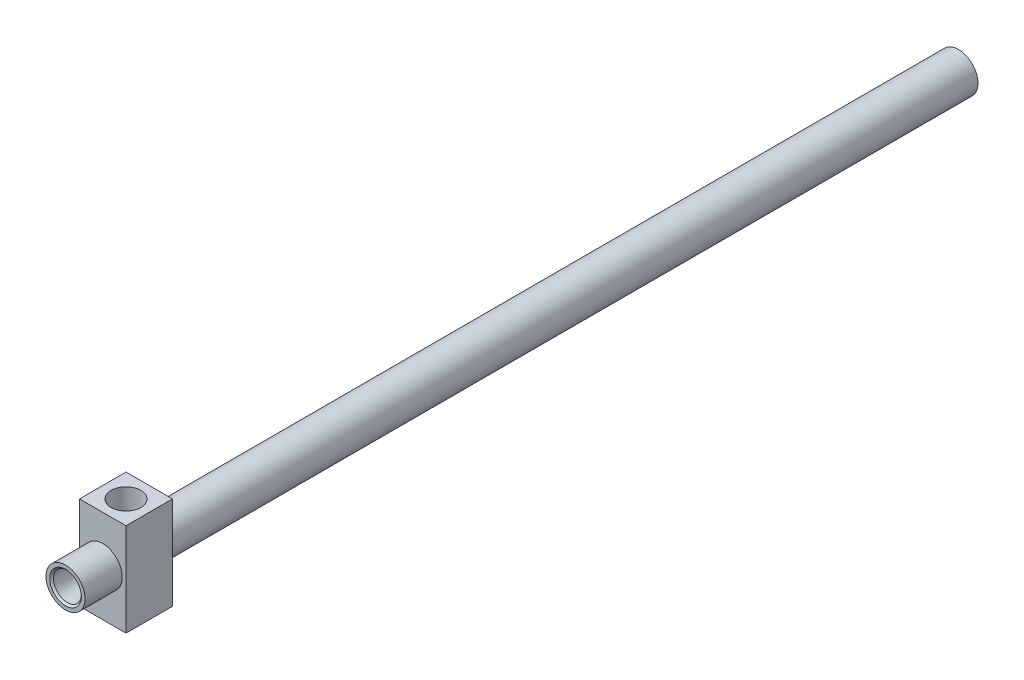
ISO-10303-21;
HEADER;
FILE_DESCRIPTION(('STEP AP214'),'2;1');
FILE_NAME('part.step','',(''),(''),'','','');
FILE_SCHEMA(('AUTOMOTIVE_DESIGN { 1 0 10303 214 1 1 1 1 }'));
ENDSEC;
DATA;
#1=APPLICATION_CONTEXT('core data for automotive mechanical design processes');
#2=APPLICATION_PROTOCOL_DEFINITION('international standard','automotive_design',2000,#1);
#3=PRODUCT_CONTEXT('',#1,'mechanical');
#4=PRODUCT('Part','Part','',(#3));
#5=PRODUCT_RELATED_PRODUCT_CATEGORY('part','',(#4));
#6=PRODUCT_DEFINITION_FORMATION('','',#4);
#7=PRODUCT_DEFINITION_CONTEXT('part definition',#1,'design');
#8=PRODUCT_DEFINITION('design','',#6,#7);
#9=PRODUCT_DEFINITION_SHAPE('','',#8);
#10=(LENGTH_UNIT() NAMED_UNIT(*) SI_UNIT(.MILLI.,.METRE.));
#11=(NAMED_UNIT(*) PLANE_ANGLE_UNIT() SI_UNIT($,.RADIAN.));
#12=(NAMED_UNIT(*) SI_UNIT($,.STERADIAN.) SOLID_ANGLE_UNIT());
#13=UNCERTAINTY_MEASURE_WITH_UNIT(LENGTH_MEASURE(1.E-05),#10,'distance_accuracy_value','');
#14=(GEOMETRIC_REPRESENTATION_CONTEXT(3) GLOBAL_UNCERTAINTY_ASSIGNED_CONTEXT((#13)) GLOBAL_UNIT_ASSIGNED_CONTEXT((#10,
#11,#12)) REPRESENTATION_CONTEXT('',''));
#15=CARTESIAN_POINT('',(0.,0.,0.));
#16=DIRECTION('',(0.,0.,1.));
#17=DIRECTION('',(1.,0.,0.));
#18=AXIS2_PLACEMENT_3D('',#15,#16,#17);
#19=CARTESIAN_POINT('',(0.,25.,12.5));
#20=DIRECTION('',(0.,-1.,0.));
#21=DIRECTION('',(0.,0.,-1.));
#22=AXIS2_PLACEMENT_3D('',#19,#20,#21);
#23=CYLINDRICAL_SURFACE('',#22,5.);
#24=CARTESIAN_POINT('',(0.,7.5,7.5));
#25=CARTESIAN_POINT('',(0.125608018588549,7.49999996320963,7.50000003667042));
#26=CARTESIAN_POINT('',(0.251216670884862,7.49683780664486,7.50473954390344));
#27=CARTESIAN_POINT('',(0.501407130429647,7.48426887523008,7.52362280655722));
#28=CARTESIAN_POINT('',(0.62598893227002,7.47486206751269,7.53776661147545));
#29=CARTESIAN_POINT('',(0.873171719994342,7.45003382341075,7.57524611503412));
#30=CARTESIAN_POINT('',(0.995772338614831,7.43461128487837,7.59858349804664));
#31=CARTESIAN_POINT('',(1.23813427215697,7.39811136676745,7.65412655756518));
#32=CARTESIAN_POINT('',(1.35789435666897,7.37703158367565,7.6863360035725));
#33=CARTESIAN_POINT('',(1.59314893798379,7.32981525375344,7.75901361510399));
#34=CARTESIAN_POINT('',(1.70866231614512,7.30370546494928,7.79943813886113));
#35=CARTESIAN_POINT('',(1.93546860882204,7.24690654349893,7.88818784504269));
#36=CARTESIAN_POINT('',(2.04675985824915,7.21621562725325,7.93651610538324));
#37=CARTESIAN_POINT('',(2.37341381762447,7.1181782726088,8.09261258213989));
#38=CARTESIAN_POINT('',(2.58175996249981,7.04482484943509,8.21155627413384));
#39=CARTESIAN_POINT('',(2.99324442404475,6.88067945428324,8.48665150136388));
#40=CARTESIAN_POINT('',(3.19444057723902,6.78893589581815,8.64510390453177));
#41=CARTESIAN_POINT('',(3.56933031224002,6.5995443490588,8.98934089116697));
#42=CARTESIAN_POINT('',(3.74298373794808,6.50188802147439,9.17516463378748));
#43=CARTESIAN_POINT('',(3.99366214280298,6.34919628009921,9.48797975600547));
#44=CARTESIAN_POINT('',(4.08060552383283,6.29351311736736,9.60683614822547));
#45=CARTESIAN_POINT('',(4.24410607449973,6.18443450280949,9.8524800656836));
#46=CARTESIAN_POINT('',(4.32066088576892,6.13103957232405,9.97926938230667));
#47=CARTESIAN_POINT('',(4.53366662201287,5.97715554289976,10.3707093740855));
#48=CARTESIAN_POINT('',(4.65396866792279,5.88264084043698,10.6470640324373));
#49=CARTESIAN_POINT('',(4.81686735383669,5.74940066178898,11.1418507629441));
#50=CARTESIAN_POINT('',(4.87187088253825,5.70244638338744,11.3539686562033));
#51=CARTESIAN_POINT('',(4.93332515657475,5.64915905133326,11.6787423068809));
#52=CARTESIAN_POINT('',(4.95029943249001,5.63425589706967,11.7880651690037));
#53=CARTESIAN_POINT('',(4.97699249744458,5.61069296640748,12.0082426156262));
#54=CARTESIAN_POINT('',(4.98671389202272,5.6020309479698,12.1190966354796));
#55=CARTESIAN_POINT('',(4.9987551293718,5.59128886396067,12.3420075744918));
#56=CARTESIAN_POINT('',(5.00104278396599,5.58923742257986,12.4540676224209));
#57=CARTESIAN_POINT('',(4.9980849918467,5.5918825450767,12.6780070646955));
#58=CARTESIAN_POINT('',(4.99283951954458,5.59657913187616,12.789886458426));
#59=CARTESIAN_POINT('',(4.97490634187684,5.61252620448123,13.0126360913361));
#60=CARTESIAN_POINT('',(4.96221454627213,5.62378029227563,13.1235057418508));
#61=CARTESIAN_POINT('',(4.92961024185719,5.65238050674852,13.3433965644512));
#62=CARTESIAN_POINT('',(4.90969480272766,5.66972910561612,13.4524169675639));
#63=CARTESIAN_POINT('',(4.84163703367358,5.72818076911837,13.7660345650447));
#64=CARTESIAN_POINT('',(4.78429713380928,5.77653702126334,13.9673662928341));
#65=CARTESIAN_POINT('',(4.64674861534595,5.88774075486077,14.3575962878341));
#66=CARTESIAN_POINT('',(4.56653247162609,5.95059300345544,14.5464904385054));
#67=CARTESIAN_POINT('',(4.36685173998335,6.09910267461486,14.9475453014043));
#68=CARTESIAN_POINT('',(4.24272264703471,6.18679835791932,15.156623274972));
#69=CARTESIAN_POINT('',(3.96670264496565,6.36729804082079,15.5534849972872));
#70=CARTESIAN_POINT('',(3.81477749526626,6.46010824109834,15.7412420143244));
#71=CARTESIAN_POINT('',(3.54969108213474,6.60779163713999,16.024372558));
#72=CARTESIAN_POINT('',(3.44464766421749,6.66328847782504,16.1271308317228));
#73=CARTESIAN_POINT('',(3.22531791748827,6.77217054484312,16.3234771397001));
#74=CARTESIAN_POINT('',(3.11103433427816,6.82555639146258,16.4170678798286));
#75=CARTESIAN_POINT('',(2.87366828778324,6.92883688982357,16.5943823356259));
#76=CARTESIAN_POINT('',(2.75059010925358,6.97873321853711,16.6781108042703));
#77=CARTESIAN_POINT('',(2.49611507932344,7.07374288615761,16.834942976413));
#78=CARTESIAN_POINT('',(2.36472076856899,7.11885767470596,16.9080499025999));
#79=CARTESIAN_POINT('',(2.12083178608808,7.1947926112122,17.029550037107));
#80=CARTESIAN_POINT('',(2.00967972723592,7.22668145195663,17.0799787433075));
#81=CARTESIAN_POINT('',(1.78295269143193,7.2859316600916,17.1729094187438));
#82=CARTESIAN_POINT('',(1.66737861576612,7.31329394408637,17.2154129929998));
#83=CARTESIAN_POINT('',(1.43245611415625,7.36291212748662,17.2920064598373));
#84=CARTESIAN_POINT('',(1.31310930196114,7.38517017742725,17.3260998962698));
#85=CARTESIAN_POINT('',(1.07138735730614,7.42408961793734,17.3854486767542));
#86=CARTESIAN_POINT('',(0.949013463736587,7.44075325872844,17.4107075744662));
#87=CARTESIAN_POINT('',(0.701493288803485,7.4681644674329,17.4521433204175));
#88=CARTESIAN_POINT('',(0.576336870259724,7.4788845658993,17.4682780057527));
#89=CARTESIAN_POINT('',(0.324780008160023,7.4940239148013,17.4910386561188));
#90=CARTESIAN_POINT('',(0.198379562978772,7.49844315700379,17.4976646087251));
#91=CARTESIAN_POINT('',(-0.0546163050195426,7.50086789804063,17.5013019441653));
#92=CARTESIAN_POINT('',(-0.181211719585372,7.49887366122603,17.4983137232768));
#93=CARTESIAN_POINT('',(-0.433544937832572,7.48852351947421,17.4827721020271));
#94=CARTESIAN_POINT('',(-0.559282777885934,7.48016788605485,17.4702191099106));
#95=CARTESIAN_POINT('',(-0.800084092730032,7.45811180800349,17.4369601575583));
#96=CARTESIAN_POINT('',(-0.915274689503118,7.44483013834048,17.4168920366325));
#97=CARTESIAN_POINT('',(-1.14332502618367,7.41323727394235,17.3689225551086));
#98=CARTESIAN_POINT('',(-1.25618396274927,7.39492437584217,17.3410185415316));
#99=CARTESIAN_POINT('',(-1.59016819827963,7.33297199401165,17.24603269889));
#100=CARTESIAN_POINT('',(-1.80689828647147,7.28229985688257,17.1676491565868));
#101=CARTESIAN_POINT('',(-2.2366977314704,7.16240567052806,16.9783628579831));
#102=CARTESIAN_POINT('',(-2.44875011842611,7.09224590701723,16.865777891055));
#103=CARTESIAN_POINT('',(-2.85169789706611,6.94004723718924,16.6139184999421));
#104=CARTESIAN_POINT('',(-3.04258010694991,6.85800100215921,16.4746275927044));
#105=CARTESIAN_POINT('',(-3.42963933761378,6.67386338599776,16.1484797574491));
#106=CARTESIAN_POINT('',(-3.62188054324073,6.57065384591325,15.9575841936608));
#107=CARTESIAN_POINT('',(-3.97334834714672,6.36427940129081,15.5472215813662));
#108=CARTESIAN_POINT('',(-4.13255212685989,6.26111457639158,15.3277349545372));
#109=CARTESIAN_POINT('',(-4.40311961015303,6.07349195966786,14.8821439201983));
#110=CARTESIAN_POINT('',(-4.51739093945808,5.98818993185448,14.6581698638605));
#111=CARTESIAN_POINT('',(-4.71240530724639,5.83597435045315,14.1903184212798));
#112=CARTESIAN_POINT('',(-4.79320869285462,5.76902777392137,13.9464778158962));
#113=CARTESIAN_POINT('',(-4.90589604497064,5.67333023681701,13.48858864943));
#114=CARTESIAN_POINT('',(-4.94396476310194,5.63987506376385,13.2770700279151));
#115=CARTESIAN_POINT('',(-4.99248032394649,5.59698654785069,12.8485672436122));
#116=CARTESIAN_POINT('',(-5.00295716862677,5.58752711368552,12.6315892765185));
#117=CARTESIAN_POINT('',(-4.99559738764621,5.59410544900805,12.1983907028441));
#118=CARTESIAN_POINT('',(-4.97774399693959,5.61015831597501,11.9821706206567));
#119=CARTESIAN_POINT('',(-4.91492740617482,5.66525973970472,11.5566473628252));
#120=CARTESIAN_POINT('',(-4.8699280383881,5.7043389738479,11.3473538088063));
#121=CARTESIAN_POINT('',(-4.73981418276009,5.81317852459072,10.88569278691));
#122=CARTESIAN_POINT('',(-4.64720557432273,5.88833948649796,10.6367080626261));
#123=CARTESIAN_POINT('',(-4.48217153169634,6.0137282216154,10.2802278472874));
#124=CARTESIAN_POINT('',(-4.4227291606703,6.05768608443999,10.164119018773));
#125=CARTESIAN_POINT('',(-4.29553797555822,6.14853438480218,9.93773662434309));
#126=CARTESIAN_POINT('',(-4.22778900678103,6.19542487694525,9.82746316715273));
#127=CARTESIAN_POINT('',(-4.0100125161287,6.34038233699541,9.50186842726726));
#128=CARTESIAN_POINT('',(-3.84739387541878,6.44119239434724,9.29593501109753));
#129=CARTESIAN_POINT('',(-3.58070368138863,6.5908294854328,9.00776376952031));
#130=CARTESIAN_POINT('',(-3.48796686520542,6.64046727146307,8.91512486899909));
#131=CARTESIAN_POINT('',(-3.29502624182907,6.73828470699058,8.73701799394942));
#132=CARTESIAN_POINT('',(-3.19482074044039,6.78646402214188,8.6515516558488));
#133=CARTESIAN_POINT('',(-2.9722858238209,6.88712610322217,8.47652614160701));
#134=CARTESIAN_POINT('',(-2.84884898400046,6.93922872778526,8.38815152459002));
#135=CARTESIAN_POINT('',(-2.59315796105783,7.03877400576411,8.22229780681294));
#136=CARTESIAN_POINT('',(-2.46090780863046,7.08621876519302,8.14481377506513));
#137=CARTESIAN_POINT('',(-2.18836443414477,7.17506685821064,8.00169721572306));
#138=CARTESIAN_POINT('',(-2.04807886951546,7.21647581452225,7.93605364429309));
#139=CARTESIAN_POINT('',(-1.76034275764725,7.29200187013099,7.81754571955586));
#140=CARTESIAN_POINT('',(-1.61289474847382,7.32612152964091,7.76467687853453));
#141=CARTESIAN_POINT('',(-1.3455542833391,7.37927647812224,7.68289967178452));
#142=CARTESIAN_POINT('',(-1.22681585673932,7.39997893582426,7.65127761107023));
#143=CARTESIAN_POINT('',(-0.986541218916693,7.43582405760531,7.59674564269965));
#144=CARTESIAN_POINT('',(-0.865005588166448,7.45096786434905,7.5738339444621));
#145=CARTESIAN_POINT('',(-0.620058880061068,7.47533722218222,7.53705165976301));
#146=CARTESIAN_POINT('',(-0.496648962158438,7.48456629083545,7.52317569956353));
#147=CARTESIAN_POINT('',(-0.24882626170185,7.49689781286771,7.50464967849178));
#148=CARTESIAN_POINT('',(-0.124413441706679,7.50000003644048,7.49999996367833));
#149=CARTESIAN_POINT('',(0.,7.5,7.5));
#150=B_SPLINE_CURVE_WITH_KNOTS('',3,(#24,#25,#26,#27,#28,#29,#30,#31,#32,#33,#34,#35,#36,#37,
#38,#39,#40,#41,#42,#43,#44,#45,#46,#47,#48,#49,#50,#51,#52,#53,#54,#55,#56,#57,#58,#59,#60,#61,
#62,#63,#64,#65,#66,#67,#68,#69,#70,#71,#72,#73,#74,#75,#76,#77,#78,#79,#80,#81,#82,#83,#84,#85,
#86,#87,#88,#89,#90,#91,#92,#93,#94,#95,#96,#97,#98,#99,#100,#101,#102,#103,#104,#105,#106,#107,
#108,#109,#110,#111,#112,#113,#114,#115,#116,#117,#118,#119,#120,#121,#122,#123,#124,#125,#126,
#127,#128,#129,#130,#131,#132,#133,#134,#135,#136,#137,#138,#139,#140,#141,#142,#143,#144,#145,
#146,#147,#148,#149),.UNSPECIFIED.,.T.,.F.,(4,2,2,2,2,2,2,2,2,2,2,2,2,2,2,2,2,2,2,2,2,2,2,2,2,2,
2,2,2,2,2,2,2,2,2,2,2,2,2,2,2,2,2,2,2,2,2,2,2,2,2,2,2,2,2,2,2,2,2,2,2,2,4),(0.,
0.376697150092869,0.7533962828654,1.13016446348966,1.5070929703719,1.88206910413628,
2.2571916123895,3.00679232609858,3.82000195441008,4.63438651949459,5.10618372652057,
5.57808786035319,6.5193034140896,7.18876311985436,7.52328813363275,7.85769291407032,
8.19354375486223,8.52939573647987,8.86543237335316,9.20160547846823,9.84356710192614,
10.4857401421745,11.2585349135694,12.032288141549,12.5030398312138,12.9736521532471,
13.44403673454,13.9142782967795,14.2923626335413,14.6703703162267,15.0482184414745,
15.4259144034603,15.8053417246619,16.184769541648,16.5641817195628,16.9435777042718,
17.2962009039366,17.6489436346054,18.3538353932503,19.1014251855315,19.8494778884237,
20.7158209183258,21.5827603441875,22.3763648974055,23.1685321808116,23.8182177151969,
24.4671965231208,25.1165595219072,25.7667896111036,26.5902817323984,27.0029102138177,
27.4155463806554,28.2552096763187,28.6754157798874,29.0957174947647,29.5765774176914,
30.0572189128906,30.5374097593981,31.0174316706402,31.3908313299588,31.7641541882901,
32.1372548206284,32.5103694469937),.UNSPECIFIED.);
#151=CARTESIAN_POINT('',(0.,7.5,7.5));
#152=VERTEX_POINT('',#151);
#153=EDGE_CURVE('E209',#152,#152,#150,.T.);
#154=ORIENTED_EDGE('',*,*,#153,.T.);
#155=EDGE_LOOP('',(#154));
#156=FACE_BOUND('',#155,.T.);
#157=CARTESIAN_POINT('',(0.,10.5,12.5));
#158=DIRECTION('',(0.,1.,0.));
#159=DIRECTION('',(0.,0.,1.));
#160=AXIS2_PLACEMENT_3D('',#157,#158,#159);
#161=CIRCLE('',#160,5.);
#162=CARTESIAN_POINT('',(0.,10.5,17.5));
#163=VERTEX_POINT('',#162);
#164=EDGE_CURVE('E120',#163,#163,#161,.T.);
#165=ORIENTED_EDGE('',*,*,#164,.T.);
#166=EDGE_LOOP('',(#165));
#167=FACE_BOUND('',#166,.T.);
#168=ADVANCED_FACE('F26',(#156,#167),#23,.F.);
#169=CARTESIAN_POINT('',(-12.5,25.,25.));
#170=DIRECTION('',(0.,0.,-1.));
#171=DIRECTION('',(-1.,0.,0.));
#172=AXIS2_PLACEMENT_3D('',#169,#170,#171);
#173=PLANE('',#172);
#174=DIRECTION('',(1.,0.,0.));
#175=VECTOR('',#174,1.);
#176=CARTESIAN_POINT('',(-12.5,-25.,25.));
#177=LINE('',#176,#175);
#178=CARTESIAN_POINT('',(-12.5,-25.,25.));
#179=VERTEX_POINT('',#178);
#180=CARTESIAN_POINT('',(12.5,-25.,25.));
#181=VERTEX_POINT('',#180);
#182=EDGE_CURVE('E67',#179,#181,#177,.T.);
#183=ORIENTED_EDGE('',*,*,#182,.T.);
#184=DIRECTION('',(0.,-1.,0.));
#185=VECTOR('',#184,1.);
#186=CARTESIAN_POINT('',(12.5,25.,25.));
#187=LINE('',#186,#185);
#188=CARTESIAN_POINT('',(12.5,25.,25.));
#189=VERTEX_POINT('',#188);
#190=EDGE_CURVE('E86',#189,#181,#187,.T.);
#191=ORIENTED_EDGE('',*,*,#190,.F.);
#192=DIRECTION('',(1.,0.,0.));
#193=VECTOR('',#192,1.);
#194=CARTESIAN_POINT('',(-12.5,25.,25.));
#195=LINE('',#194,#193);
#196=CARTESIAN_POINT('',(-12.5,25.,25.));
#197=VERTEX_POINT('',#196);
#198=EDGE_CURVE('E82',#197,#189,#195,.T.);
#199=ORIENTED_EDGE('',*,*,#198,.F.);
#200=DIRECTION('',(0.,-1.,0.));
#201=VECTOR('',#200,1.);
#202=CARTESIAN_POINT('',(-12.5,25.,25.));
#203=LINE('',#202,#201);
#204=EDGE_CURVE('E79',#197,#179,#203,.T.);
#205=ORIENTED_EDGE('',*,*,#204,.T.);
#206=EDGE_LOOP('',(#183,#191,#199,#205));
#207=FACE_BOUND('',#206,.T.);
#208=CARTESIAN_POINT('',(0.,0.,25.));
#209=DIRECTION('',(0.,0.,-1.));
#210=DIRECTION('',(-1.,0.,0.));
#211=AXIS2_PLACEMENT_3D('',#208,#209,#210);
#212=CIRCLE('',#211,10.5);
#213=CARTESIAN_POINT('',(-10.5,0.,25.));
#214=VERTEX_POINT('',#213);
#215=EDGE_CURVE('E116',#214,#214,#212,.F.);
#216=ORIENTED_EDGE('',*,*,#215,.F.);
#217=EDGE_LOOP('',(#216));
#218=FACE_BOUND('',#217,.T.);
#219=ADVANCED_FACE('F80',(#207,#218),#173,.F.);
#220=CARTESIAN_POINT('',(0.,0.,-435.));
#221=DIRECTION('',(0.,0.,1.));
#222=DIRECTION('',(1.,0.,0.));
#223=AXIS2_PLACEMENT_3D('',#220,#221,#222);
#224=CYLINDRICAL_SURFACE('',#223,10.5);
#225=CARTESIAN_POINT('',(0.,0.,-435.));
#226=DIRECTION('',(0.,0.,1.));
#227=DIRECTION('',(1.,0.,0.));
#228=AXIS2_PLACEMENT_3D('',#225,#226,#227);
#229=CIRCLE('',#228,10.5);
#230=CARTESIAN_POINT('',(10.5,0.,-435.));
#231=VERTEX_POINT('',#230);
#232=EDGE_CURVE('E113',#231,#231,#229,.T.);
#233=CARTESIAN_POINT('',(0.,0.,0.));
#234=DIRECTION('',(0.,0.,1.));
#235=DIRECTION('',(1.,0.,0.));
#236=AXIS2_PLACEMENT_3D('',#233,#234,#235);
#237=CIRCLE('',#236,10.5);
#238=CARTESIAN_POINT('',(10.5,0.,0.));
#239=VERTEX_POINT('',#238);
#240=EDGE_CURVE('E85',#239,#239,#237,.T.);
#241=CARTESIAN_POINT('',(10.5,0.,-435.));
#242=CARTESIAN_POINT('',(10.5,0.,-430.46875));
#243=CARTESIAN_POINT('',(10.5,0.,-425.9375));
#244=CARTESIAN_POINT('',(10.5,0.,-416.875));
#245=CARTESIAN_POINT('',(10.5,0.,-412.34375));
#246=CARTESIAN_POINT('',(10.5,0.,-403.28125));
#247=CARTESIAN_POINT('',(10.5,0.,-398.75));
#248=CARTESIAN_POINT('',(10.5,0.,-389.6875));
#249=CARTESIAN_POINT('',(10.5,0.,-385.15625));
#250=CARTESIAN_POINT('',(10.5,0.,-376.09375));
#251=CARTESIAN_POINT('',(10.5,0.,-371.5625));
#252=CARTESIAN_POINT('',(10.5,0.,-362.5));
#253=CARTESIAN_POINT('',(10.5,0.,-357.96875));
#254=CARTESIAN_POINT('',(10.5,0.,-348.90625));
#255=CARTESIAN_POINT('',(10.5,0.,-344.375));
#256=CARTESIAN_POINT('',(10.5,0.,-335.3125));
#257=CARTESIAN_POINT('',(10.5,0.,-330.78125));
#258=CARTESIAN_POINT('',(10.5,0.,-321.71875));
#259=CARTESIAN_POINT('',(10.5,0.,-317.1875));
#260=CARTESIAN_POINT('',(10.5,0.,-308.125));
#261=CARTESIAN_POINT('',(10.5,0.,-303.59375));
#262=CARTESIAN_POINT('',(10.5,0.,-294.53125));
#263=CARTESIAN_POINT('',(10.5,0.,-290.));
#264=CARTESIAN_POINT('',(10.5,0.,-280.9375));
#265=CARTESIAN_POINT('',(10.5,0.,-276.40625));
#266=CARTESIAN_POINT('',(10.5,0.,-267.34375));
#267=CARTESIAN_POINT('',(10.5,0.,-262.8125));
#268=CARTESIAN_POINT('',(10.5,0.,-253.75));
#269=CARTESIAN_POINT('',(10.5,0.,-249.21875));
#270=CARTESIAN_POINT('',(10.5,0.,-240.15625));
#271=CARTESIAN_POINT('',(10.5,0.,-235.625));
#272=CARTESIAN_POINT('',(10.5,0.,-226.5625));
#273=CARTESIAN_POINT('',(10.5,0.,-222.03125));
#274=CARTESIAN_POINT('',(10.5,0.,-212.96875));
#275=CARTESIAN_POINT('',(10.5,0.,-208.4375));
#276=CARTESIAN_POINT('',(10.5,0.,-199.375));
#277=CARTESIAN_POINT('',(10.5,0.,-194.84375));
#278=CARTESIAN_POINT('',(10.5,0.,-185.78125));
#279=CARTESIAN_POINT('',(10.5,0.,-181.25));
#280=CARTESIAN_POINT('',(10.5,0.,-172.1875));
#281=CARTESIAN_POINT('',(10.5,0.,-167.65625));
#282=CARTESIAN_POINT('',(10.5,0.,-158.59375));
#283=CARTESIAN_POINT('',(10.5,0.,-154.0625));
#284=CARTESIAN_POINT('',(10.5,0.,-145.));
#285=CARTESIAN_POINT('',(10.5,0.,-140.46875));
#286=CARTESIAN_POINT('',(10.5,0.,-131.40625));
#287=CARTESIAN_POINT('',(10.5,0.,-126.875));
#288=CARTESIAN_POINT('',(10.5,0.,-117.8125));
#289=CARTESIAN_POINT('',(10.5,0.,-113.28125));
#290=CARTESIAN_POINT('',(10.5,0.,-104.21875));
#291=CARTESIAN_POINT('',(10.5,0.,-99.6875));
#292=CARTESIAN_POINT('',(10.5,0.,-90.625));
#293=CARTESIAN_POINT('',(10.5,0.,-86.09375));
#294=CARTESIAN_POINT('',(10.5,0.,-77.03125));
#295=CARTESIAN_POINT('',(10.5,0.,-72.5));
#296=CARTESIAN_POINT('',(10.5,0.,-63.4375));
#297=CARTESIAN_POINT('',(10.5,0.,-58.90625));
#298=CARTESIAN_POINT('',(10.5,0.,-49.84375));
#299=CARTESIAN_POINT('',(10.5,0.,-45.3125));
#300=CARTESIAN_POINT('',(10.5,0.,-36.25));
#301=CARTESIAN_POINT('',(10.5,0.,-31.71875));
#302=CARTESIAN_POINT('',(10.5,0.,-22.65625));
#303=CARTESIAN_POINT('',(10.5,0.,-18.125));
#304=CARTESIAN_POINT('',(10.5,0.,-9.06250000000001));
#305=CARTESIAN_POINT('',(10.5,0.,-4.53125));
#306=CARTESIAN_POINT('',(10.5,0.,0.));
#307=B_SPLINE_CURVE_WITH_KNOTS('',3,(#241,#242,#243,#244,#245,#246,#247,#248,#249,#250,#251,
#252,#253,#254,#255,#256,#257,#258,#259,#260,#261,#262,#263,#264,#265,#266,#267,#268,#269,#270,
#271,#272,#273,#274,#275,#276,#277,#278,#279,#280,#281,#282,#283,#284,#285,#286,#287,#288,#289,
#290,#291,#292,#293,#294,#295,#296,#297,#298,#299,#300,#301,#302,#303,#304,#305,#306),
.UNSPECIFIED.,.F.,.F.,(4,2,2,2,2,2,2,2,2,2,2,2,2,2,2,2,2,2,2,2,2,2,2,2,2,2,2,2,2,2,2,2,4),(0.,
13.59375,27.1875,40.78125,54.375,67.96875,81.5625,95.15625,108.75,122.34375,135.9375,149.53125,
163.125,176.71875,190.3125,203.90625,217.5,231.09375,244.6875,258.28125,271.875,285.46875,
299.0625,312.65625,326.25,339.84375,353.4375,367.03125,380.625,394.21875,407.8125,421.40625,
435.),.UNSPECIFIED.);
#308=EDGE_CURVE('BSEAM28',#231,#239,#307,.T.);
#309=ORIENTED_EDGE('',*,*,#232,.T.);
#310=ORIENTED_EDGE('',*,*,#240,.F.);
#311=ORIENTED_EDGE('',*,*,#308,.T.);
#312=ORIENTED_EDGE('',*,*,#308,.F.);
#313=EDGE_LOOP('',(#309,#311,#310,#312));
#314=FACE_BOUND('',#313,.T.);
#315=ADVANCED_FACE('F28',(#314),#224,.T.);
#316=CARTESIAN_POINT('',(0.,0.,-435.));
#317=DIRECTION('',(0.,0.,1.));
#318=DIRECTION('',(1.,0.,0.));
#319=AXIS2_PLACEMENT_3D('',#316,#317,#318);
#320=PLANE('',#319);
#321=CARTESIAN_POINT('',(0.,0.,-435.));
#322=DIRECTION('',(0.,0.,1.));
#323=DIRECTION('',(1.,0.,0.));
#324=AXIS2_PLACEMENT_3D('',#321,#322,#323);
#325=CIRCLE('',#324,8.5);
#326=CARTESIAN_POINT('',(8.5,0.,-435.));
#327=VERTEX_POINT('',#326);
#328=EDGE_CURVE('E124',#327,#327,#325,.T.);
#329=ORIENTED_EDGE('',*,*,#328,.T.);
#330=EDGE_LOOP('',(#329));
#331=FACE_BOUND('',#330,.T.);
#332=ORIENTED_EDGE('',*,*,#232,.F.);
#333=EDGE_LOOP('',(#332));
#334=FACE_BOUND('',#333,.T.);
#335=ADVANCED_FACE('F142',(#331,#334),#320,.F.);
#336=CARTESIAN_POINT('',(-12.5,25.,0.));
#337=DIRECTION('',(1.,0.,0.));
#338=DIRECTION('',(0.,0.,-1.));
#339=AXIS2_PLACEMENT_3D('',#336,#337,#338);
#340=PLANE('',#339);
#341=DIRECTION('',(0.,0.,1.));
#342=VECTOR('',#341,1.);
#343=CARTESIAN_POINT('',(-12.5,-25.,0.));
#344=LINE('',#343,#342);
#345=CARTESIAN_POINT('',(-12.5,-25.,0.));
#346=VERTEX_POINT('',#345);
#347=EDGE_CURVE('E72',#346,#179,#344,.T.);
#348=ORIENTED_EDGE('',*,*,#347,.T.);
#349=ORIENTED_EDGE('',*,*,#204,.F.);
#350=DIRECTION('',(0.,0.,1.));
#351=VECTOR('',#350,1.);
#352=CARTESIAN_POINT('',(-12.5,25.,0.));
#353=LINE('',#352,#351);
#354=CARTESIAN_POINT('',(-12.5,25.,0.));
#355=VERTEX_POINT('',#354);
#356=EDGE_CURVE('E101',#355,#197,#353,.T.);
#357=ORIENTED_EDGE('',*,*,#356,.F.);
#358=DIRECTION('',(0.,-1.,0.));
#359=VECTOR('',#358,1.);
#360=CARTESIAN_POINT('',(-12.5,25.,0.));
#361=LINE('',#360,#359);
#362=EDGE_CURVE('E90',#355,#346,#361,.T.);
#363=ORIENTED_EDGE('',*,*,#362,.T.);
#364=EDGE_LOOP('',(#348,#349,#357,#363));
#365=FACE_BOUND('',#364,.T.);
#366=ADVANCED_FACE('F89',(#365),#340,.F.);
#367=CARTESIAN_POINT('',(12.5,25.,0.));
#368=DIRECTION('',(-1.,0.,0.));
#369=DIRECTION('',(0.,0.,1.));
#370=AXIS2_PLACEMENT_3D('',#367,#368,#369);
#371=PLANE('',#370);
#372=DIRECTION('',(0.,0.,-1.));
#373=VECTOR('',#372,1.);
#374=CARTESIAN_POINT('',(12.5,-25.,0.));
#375=LINE('',#374,#373);
#376=CARTESIAN_POINT('',(12.5,-25.,0.));
#377=VERTEX_POINT('',#376);
#378=EDGE_CURVE('E73',#181,#377,#375,.T.);
#379=ORIENTED_EDGE('',*,*,#378,.T.);
#380=DIRECTION('',(0.,-1.,0.));
#381=VECTOR('',#380,1.);
#382=CARTESIAN_POINT('',(12.5,25.,0.));
#383=LINE('',#382,#381);
#384=CARTESIAN_POINT('',(12.5,25.,0.));
#385=VERTEX_POINT('',#384);
#386=EDGE_CURVE('E107',#385,#377,#383,.T.);
#387=ORIENTED_EDGE('',*,*,#386,.F.);
#388=DIRECTION('',(0.,0.,-1.));
#389=VECTOR('',#388,1.);
#390=CARTESIAN_POINT('',(12.5,25.,0.));
#391=LINE('',#390,#389);
#392=EDGE_CURVE('E46',#189,#385,#391,.T.);
#393=ORIENTED_EDGE('',*,*,#392,.F.);
#394=ORIENTED_EDGE('',*,*,#190,.T.);
#395=EDGE_LOOP('',(#379,#387,#393,#394));
#396=FACE_BOUND('',#395,.T.);
#397=ADVANCED_FACE('F155',(#396),#371,.F.);
#398=CARTESIAN_POINT('',(-12.5,25.,0.));
#399=DIRECTION('',(0.,0.,1.));
#400=DIRECTION('',(1.,0.,0.));
#401=AXIS2_PLACEMENT_3D('',#398,#399,#400);
#402=PLANE('',#401);
#403=ORIENTED_EDGE('',*,*,#240,.T.);
#404=EDGE_LOOP('',(#403));
#405=FACE_BOUND('',#404,.T.);
#406=DIRECTION('',(-1.,0.,0.));
#407=VECTOR('',#406,1.);
#408=CARTESIAN_POINT('',(-12.5,-25.,0.));
#409=LINE('',#408,#407);
#410=EDGE_CURVE('E99',#377,#346,#409,.T.);
#411=ORIENTED_EDGE('',*,*,#410,.T.);
#412=ORIENTED_EDGE('',*,*,#362,.F.);
#413=DIRECTION('',(-1.,0.,0.));
#414=VECTOR('',#413,1.);
#415=CARTESIAN_POINT('',(-12.5,25.,0.));
#416=LINE('',#415,#414);
#417=EDGE_CURVE('E41',#385,#355,#416,.T.);
#418=ORIENTED_EDGE('',*,*,#417,.F.);
#419=ORIENTED_EDGE('',*,*,#386,.T.);
#420=EDGE_LOOP('',(#411,#412,#418,#419));
#421=FACE_BOUND('',#420,.T.);
#422=ADVANCED_FACE('F151',(#405,#421),#402,.F.);
#423=CARTESIAN_POINT('',(-12.5,25.,25.));
#424=DIRECTION('',(0.,1.,0.));
#425=DIRECTION('',(0.,0.,1.));
#426=AXIS2_PLACEMENT_3D('',#423,#424,#425);
#427=PLANE('',#426);
#428=CARTESIAN_POINT('',(0.,25.,12.5));
#429=DIRECTION('',(0.,1.,0.));
#430=DIRECTION('',(0.,0.,1.));
#431=AXIS2_PLACEMENT_3D('',#428,#429,#430);
#432=CIRCLE('',#431,8.);
#433=CARTESIAN_POINT('',(0.,25.,20.5));
#434=VERTEX_POINT('',#433);
#435=EDGE_CURVE('E94',#434,#434,#432,.T.);
#436=ORIENTED_EDGE('',*,*,#435,.F.);
#437=EDGE_LOOP('',(#436));
#438=FACE_BOUND('',#437,.T.);
#439=ORIENTED_EDGE('',*,*,#356,.T.);
#440=ORIENTED_EDGE('',*,*,#198,.T.);
#441=ORIENTED_EDGE('',*,*,#392,.T.);
#442=ORIENTED_EDGE('',*,*,#417,.T.);
#443=EDGE_LOOP('',(#439,#440,#441,#442));
#444=FACE_BOUND('',#443,.T.);
#445=ADVANCED_FACE('F154',(#438,#444),#427,.T.);
#446=CARTESIAN_POINT('',(-12.5,-25.,25.));
#447=DIRECTION('',(0.,1.,0.));
#448=DIRECTION('',(0.,0.,1.));
#449=AXIS2_PLACEMENT_3D('',#446,#447,#448);
#450=PLANE('',#449);
#451=CARTESIAN_POINT('',(0.,-25.,12.5));
#452=DIRECTION('',(0.,-1.,0.));
#453=DIRECTION('',(0.,0.,-1.));
#454=AXIS2_PLACEMENT_3D('',#451,#452,#453);
#455=CIRCLE('',#454,8.);
#456=CARTESIAN_POINT('',(0.,-25.,4.5));
#457=VERTEX_POINT('',#456);
#458=EDGE_CURVE('E199',#457,#457,#455,.T.);
#459=ORIENTED_EDGE('',*,*,#458,.F.);
#460=EDGE_LOOP('',(#459));
#461=FACE_BOUND('',#460,.T.);
#462=ORIENTED_EDGE('',*,*,#347,.F.);
#463=ORIENTED_EDGE('',*,*,#410,.F.);
#464=ORIENTED_EDGE('',*,*,#378,.F.);
#465=ORIENTED_EDGE('',*,*,#182,.F.);
#466=EDGE_LOOP('',(#462,#463,#464,#465));
#467=FACE_BOUND('',#466,.T.);
#468=ADVANCED_FACE('F69',(#461,#467),#450,.F.);
#469=CARTESIAN_POINT('',(0.,10.5,12.5));
#470=DIRECTION('',(0.,1.,0.));
#471=DIRECTION('',(0.,0.,1.));
#472=AXIS2_PLACEMENT_3D('',#469,#470,#471);
#473=CYLINDRICAL_SURFACE('',#472,8.);
#474=CARTESIAN_POINT('',(0.,10.5,12.5));
#475=DIRECTION('',(0.,1.,0.));
#476=DIRECTION('',(0.,0.,1.));
#477=AXIS2_PLACEMENT_3D('',#474,#475,#476);
#478=CIRCLE('',#477,8.);
#479=CARTESIAN_POINT('',(0.,10.5,20.5));
#480=VERTEX_POINT('',#479);
#481=EDGE_CURVE('E91',#480,#480,#478,.T.);
#482=CARTESIAN_POINT('',(0.,10.5,20.5));
#483=CARTESIAN_POINT('',(0.,10.6510416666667,20.5));
#484=CARTESIAN_POINT('',(0.,10.8020833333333,20.5));
#485=CARTESIAN_POINT('',(0.,11.1041666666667,20.5));
#486=CARTESIAN_POINT('',(0.,11.2552083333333,20.5));
#487=CARTESIAN_POINT('',(0.,11.5572916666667,20.5));
#488=CARTESIAN_POINT('',(0.,11.7083333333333,20.5));
#489=CARTESIAN_POINT('',(0.,12.0104166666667,20.5));
#490=CARTESIAN_POINT('',(0.,12.1614583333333,20.5));
#491=CARTESIAN_POINT('',(0.,12.4635416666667,20.5));
#492=CARTESIAN_POINT('',(0.,12.6145833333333,20.5));
#493=CARTESIAN_POINT('',(0.,12.9166666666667,20.5));
#494=CARTESIAN_POINT('',(0.,13.0677083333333,20.5));
#495=CARTESIAN_POINT('',(0.,13.3697916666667,20.5));
#496=CARTESIAN_POINT('',(0.,13.5208333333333,20.5));
#497=CARTESIAN_POINT('',(0.,13.8229166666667,20.5));
#498=CARTESIAN_POINT('',(0.,13.9739583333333,20.5));
#499=CARTESIAN_POINT('',(0.,14.2760416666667,20.5));
#500=CARTESIAN_POINT('',(0.,14.4270833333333,20.5));
#501=CARTESIAN_POINT('',(0.,14.7291666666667,20.5));
#502=CARTESIAN_POINT('',(0.,14.8802083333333,20.5));
#503=CARTESIAN_POINT('',(0.,15.1822916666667,20.5));
#504=CARTESIAN_POINT('',(0.,15.3333333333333,20.5));
#505=CARTESIAN_POINT('',(0.,15.6354166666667,20.5));
#506=CARTESIAN_POINT('',(0.,15.7864583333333,20.5));
#507=CARTESIAN_POINT('',(0.,16.0885416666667,20.5));
#508=CARTESIAN_POINT('',(0.,16.2395833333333,20.5));
#509=CARTESIAN_POINT('',(0.,16.5416666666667,20.5));
#510=CARTESIAN_POINT('',(0.,16.6927083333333,20.5));
#511=CARTESIAN_POINT('',(0.,16.9947916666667,20.5));
#512=CARTESIAN_POINT('',(0.,17.1458333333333,20.5));
#513=CARTESIAN_POINT('',(0.,17.4479166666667,20.5));
#514=CARTESIAN_POINT('',(0.,17.5989583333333,20.5));
#515=CARTESIAN_POINT('',(0.,17.9010416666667,20.5));
#516=CARTESIAN_POINT('',(0.,18.0520833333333,20.5));
#517=CARTESIAN_POINT('',(0.,18.3541666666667,20.5));
#518=CARTESIAN_POINT('',(0.,18.5052083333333,20.5));
#519=CARTESIAN_POINT('',(0.,18.8072916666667,20.5));
#520=CARTESIAN_POINT('',(0.,18.9583333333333,20.5));
#521=CARTESIAN_POINT('',(0.,19.2604166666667,20.5));
#522=CARTESIAN_POINT('',(0.,19.4114583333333,20.5));
#523=CARTESIAN_POINT('',(0.,19.7135416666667,20.5));
#524=CARTESIAN_POINT('',(0.,19.8645833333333,20.5));
#525=CARTESIAN_POINT('',(0.,20.1666666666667,20.5));
#526=CARTESIAN_POINT('',(0.,20.3177083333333,20.5));
#527=CARTESIAN_POINT('',(0.,20.6197916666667,20.5));
#528=CARTESIAN_POINT('',(0.,20.7708333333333,20.5));
#529=CARTESIAN_POINT('',(0.,21.0729166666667,20.5));
#530=CARTESIAN_POINT('',(0.,21.2239583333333,20.5));
#531=CARTESIAN_POINT('',(0.,21.5260416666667,20.5));
#532=CARTESIAN_POINT('',(0.,21.6770833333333,20.5));
#533=CARTESIAN_POINT('',(0.,21.9791666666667,20.5));
#534=CARTESIAN_POINT('',(0.,22.1302083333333,20.5));
#535=CARTESIAN_POINT('',(0.,22.4322916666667,20.5));
#536=CARTESIAN_POINT('',(0.,22.5833333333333,20.5));
#537=CARTESIAN_POINT('',(0.,22.8854166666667,20.5));
#538=CARTESIAN_POINT('',(0.,23.0364583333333,20.5));
#539=CARTESIAN_POINT('',(0.,23.3385416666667,20.5));
#540=CARTESIAN_POINT('',(0.,23.4895833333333,20.5));
#541=CARTESIAN_POINT('',(0.,23.7916666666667,20.5));
#542=CARTESIAN_POINT('',(0.,23.9427083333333,20.5));
#543=CARTESIAN_POINT('',(0.,24.2447916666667,20.5));
#544=CARTESIAN_POINT('',(0.,24.3958333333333,20.5));
#545=CARTESIAN_POINT('',(0.,24.6979166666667,20.5));
#546=CARTESIAN_POINT('',(0.,24.8489583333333,20.5));
#547=CARTESIAN_POINT('',(0.,25.,20.5));
#548=B_SPLINE_CURVE_WITH_KNOTS('',3,(#482,#483,#484,#485,#486,#487,#488,#489,#490,#491,#492,
#493,#494,#495,#496,#497,#498,#499,#500,#501,#502,#503,#504,#505,#506,#507,#508,#509,#510,#511,
#512,#513,#514,#515,#516,#517,#518,#519,#520,#521,#522,#523,#524,#525,#526,#527,#528,#529,#530,
#531,#532,#533,#534,#535,#536,#537,#538,#539,#540,#541,#542,#543,#544,#545,#546,#547),
.UNSPECIFIED.,.F.,.F.,(4,2,2,2,2,2,2,2,2,2,2,2,2,2,2,2,2,2,2,2,2,2,2,2,2,2,2,2,2,2,2,2,4),(0.,
0.453124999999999,0.906249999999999,1.359375,1.8125,2.265625,2.71875,3.171875,3.625,4.078125,
4.53125,4.984375,5.4375,5.890625,6.34375,6.796875,7.25,7.703125,8.15625,8.609375,9.0625,
9.515625,9.96875,10.421875,10.875,11.328125,11.78125,12.234375,12.6875,13.140625,13.59375,
14.046875,14.5),.UNSPECIFIED.);
#549=EDGE_CURVE('BSEAM280',#480,#434,#548,.T.);
#550=ORIENTED_EDGE('',*,*,#481,.F.);
#551=ORIENTED_EDGE('',*,*,#435,.T.);
#552=ORIENTED_EDGE('',*,*,#549,.T.);
#553=ORIENTED_EDGE('',*,*,#549,.F.);
#554=EDGE_LOOP('',(#550,#552,#551,#553));
#555=FACE_BOUND('',#554,.T.);
#556=ADVANCED_FACE('F280',(#555),#473,.F.);
#557=CARTESIAN_POINT('',(0.,10.5,12.5));
#558=DIRECTION('',(0.,1.,0.));
#559=DIRECTION('',(0.,0.,1.));
#560=AXIS2_PLACEMENT_3D('',#557,#558,#559);
#561=PLANE('',#560);
#562=ORIENTED_EDGE('',*,*,#164,.F.);
#563=EDGE_LOOP('',(#562));
#564=FACE_BOUND('',#563,.T.);
#565=ORIENTED_EDGE('',*,*,#481,.T.);
#566=EDGE_LOOP('',(#565));
#567=FACE_BOUND('',#566,.T.);
#568=ADVANCED_FACE('F273',(#564,#567),#561,.T.);
#569=CARTESIAN_POINT('',(0.,-10.5,12.5));
#570=DIRECTION('',(0.,-1.,0.));
#571=DIRECTION('',(0.,0.,-1.));
#572=AXIS2_PLACEMENT_3D('',#569,#570,#571);
#573=CYLINDRICAL_SURFACE('',#572,8.);
#574=CARTESIAN_POINT('',(0.,-10.5,12.5));
#575=DIRECTION('',(0.,-1.,0.));
#576=DIRECTION('',(0.,0.,-1.));
#577=AXIS2_PLACEMENT_3D('',#574,#575,#576);
#578=CIRCLE('',#577,8.);
#579=CARTESIAN_POINT('',(0.,-10.5,4.5));
#580=VERTEX_POINT('',#579);
#581=EDGE_CURVE('E197',#580,#580,#578,.T.);
#582=CARTESIAN_POINT('',(0.,-10.5,4.5));
#583=CARTESIAN_POINT('',(0.,-10.6510416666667,4.5));
#584=CARTESIAN_POINT('',(0.,-10.8020833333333,4.5));
#585=CARTESIAN_POINT('',(0.,-11.1041666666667,4.5));
#586=CARTESIAN_POINT('',(0.,-11.2552083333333,4.5));
#587=CARTESIAN_POINT('',(0.,-11.5572916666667,4.5));
#588=CARTESIAN_POINT('',(0.,-11.7083333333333,4.5));
#589=CARTESIAN_POINT('',(0.,-12.0104166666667,4.5));
#590=CARTESIAN_POINT('',(0.,-12.1614583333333,4.5));
#591=CARTESIAN_POINT('',(0.,-12.4635416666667,4.5));
#592=CARTESIAN_POINT('',(0.,-12.6145833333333,4.5));
#593=CARTESIAN_POINT('',(0.,-12.9166666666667,4.5));
#594=CARTESIAN_POINT('',(0.,-13.0677083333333,4.5));
#595=CARTESIAN_POINT('',(0.,-13.3697916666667,4.5));
#596=CARTESIAN_POINT('',(0.,-13.5208333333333,4.5));
#597=CARTESIAN_POINT('',(0.,-13.8229166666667,4.5));
#598=CARTESIAN_POINT('',(0.,-13.9739583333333,4.5));
#599=CARTESIAN_POINT('',(0.,-14.2760416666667,4.5));
#600=CARTESIAN_POINT('',(0.,-14.4270833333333,4.5));
#601=CARTESIAN_POINT('',(0.,-14.7291666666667,4.5));
#602=CARTESIAN_POINT('',(0.,-14.8802083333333,4.5));
#603=CARTESIAN_POINT('',(0.,-15.1822916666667,4.5));
#604=CARTESIAN_POINT('',(0.,-15.3333333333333,4.5));
#605=CARTESIAN_POINT('',(0.,-15.6354166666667,4.5));
#606=CARTESIAN_POINT('',(0.,-15.7864583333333,4.5));
#607=CARTESIAN_POINT('',(0.,-16.0885416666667,4.5));
#608=CARTESIAN_POINT('',(0.,-16.2395833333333,4.5));
#609=CARTESIAN_POINT('',(0.,-16.5416666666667,4.5));
#610=CARTESIAN_POINT('',(0.,-16.6927083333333,4.5));
#611=CARTESIAN_POINT('',(0.,-16.9947916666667,4.5));
#612=CARTESIAN_POINT('',(0.,-17.1458333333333,4.5));
#613=CARTESIAN_POINT('',(0.,-17.4479166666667,4.5));
#614=CARTESIAN_POINT('',(0.,-17.5989583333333,4.5));
#615=CARTESIAN_POINT('',(0.,-17.9010416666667,4.5));
#616=CARTESIAN_POINT('',(0.,-18.0520833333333,4.5));
#617=CARTESIAN_POINT('',(0.,-18.3541666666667,4.5));
#618=CARTESIAN_POINT('',(0.,-18.5052083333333,4.5));
#619=CARTESIAN_POINT('',(0.,-18.8072916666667,4.5));
#620=CARTESIAN_POINT('',(0.,-18.9583333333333,4.5));
#621=CARTESIAN_POINT('',(0.,-19.2604166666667,4.5));
#622=CARTESIAN_POINT('',(0.,-19.4114583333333,4.5));
#623=CARTESIAN_POINT('',(0.,-19.7135416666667,4.5));
#624=CARTESIAN_POINT('',(0.,-19.8645833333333,4.5));
#625=CARTESIAN_POINT('',(0.,-20.1666666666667,4.5));
#626=CARTESIAN_POINT('',(0.,-20.3177083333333,4.5));
#627=CARTESIAN_POINT('',(0.,-20.6197916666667,4.5));
#628=CARTESIAN_POINT('',(0.,-20.7708333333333,4.5));
#629=CARTESIAN_POINT('',(0.,-21.0729166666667,4.5));
#630=CARTESIAN_POINT('',(0.,-21.2239583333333,4.5));
#631=CARTESIAN_POINT('',(0.,-21.5260416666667,4.5));
#632=CARTESIAN_POINT('',(0.,-21.6770833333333,4.5));
#633=CARTESIAN_POINT('',(0.,-21.9791666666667,4.5));
#634=CARTESIAN_POINT('',(0.,-22.1302083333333,4.5));
#635=CARTESIAN_POINT('',(0.,-22.4322916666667,4.5));
#636=CARTESIAN_POINT('',(0.,-22.5833333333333,4.5));
#637=CARTESIAN_POINT('',(0.,-22.8854166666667,4.5));
#638=CARTESIAN_POINT('',(0.,-23.0364583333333,4.5));
#639=CARTESIAN_POINT('',(0.,-23.3385416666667,4.5));
#640=CARTESIAN_POINT('',(0.,-23.4895833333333,4.5));
#641=CARTESIAN_POINT('',(0.,-23.7916666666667,4.5));
#642=CARTESIAN_POINT('',(0.,-23.9427083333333,4.5));
#643=CARTESIAN_POINT('',(0.,-24.2447916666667,4.5));
#644=CARTESIAN_POINT('',(0.,-24.3958333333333,4.5));
#645=CARTESIAN_POINT('',(0.,-24.6979166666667,4.5));
#646=CARTESIAN_POINT('',(0.,-24.8489583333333,4.5));
#647=CARTESIAN_POINT('',(0.,-25.,4.5));
#648=B_SPLINE_CURVE_WITH_KNOTS('',3,(#582,#583,#584,#585,#586,#587,#588,#589,#590,#591,#592,
#593,#594,#595,#596,#597,#598,#599,#600,#601,#602,#603,#604,#605,#606,#607,#608,#609,#610,#611,
#612,#613,#614,#615,#616,#617,#618,#619,#620,#621,#622,#623,#624,#625,#626,#627,#628,#629,#630,
#631,#632,#633,#634,#635,#636,#637,#638,#639,#640,#641,#642,#643,#644,#645,#646,#647),
.UNSPECIFIED.,.F.,.F.,(4,2,2,2,2,2,2,2,2,2,2,2,2,2,2,2,2,2,2,2,2,2,2,2,2,2,2,2,2,2,2,2,4),(0.,
0.453124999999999,0.906249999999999,1.359375,1.8125,2.265625,2.71875,3.171875,3.625,4.078125,
4.53125,4.984375,5.4375,5.890625,6.34375,6.796875,7.25,7.703125,8.15625,8.609375,9.0625,
9.515625,9.96875,10.421875,10.875,11.328125,11.78125,12.234375,12.6875,13.140625,13.59375,
14.046875,14.5),.UNSPECIFIED.);
#649=EDGE_CURVE('BSEAM187',#580,#457,#648,.T.);
#650=ORIENTED_EDGE('',*,*,#581,.F.);
#651=ORIENTED_EDGE('',*,*,#458,.T.);
#652=ORIENTED_EDGE('',*,*,#649,.T.);
#653=ORIENTED_EDGE('',*,*,#649,.F.);
#654=EDGE_LOOP('',(#650,#652,#651,#653));
#655=FACE_BOUND('',#654,.T.);
#656=ADVANCED_FACE('F187',(#655),#573,.F.);
#657=CARTESIAN_POINT('',(0.,-10.5,12.5));
#658=DIRECTION('',(0.,-1.,0.));
#659=DIRECTION('',(0.,0.,-1.));
#660=AXIS2_PLACEMENT_3D('',#657,#658,#659);
#661=PLANE('',#660);
#662=CARTESIAN_POINT('',(0.,-10.5,12.5));
#663=DIRECTION('',(0.,-1.,0.));
#664=DIRECTION('',(0.,0.,-1.));
#665=AXIS2_PLACEMENT_3D('',#662,#663,#664);
#666=CIRCLE('',#665,5.);
#667=CARTESIAN_POINT('',(0.,-10.5,7.5));
#668=VERTEX_POINT('',#667);
#669=EDGE_CURVE('E117',#668,#668,#666,.T.);
#670=ORIENTED_EDGE('',*,*,#669,.F.);
#671=EDGE_LOOP('',(#670));
#672=FACE_BOUND('',#671,.T.);
#673=ORIENTED_EDGE('',*,*,#581,.T.);
#674=EDGE_LOOP('',(#673));
#675=FACE_BOUND('',#674,.T.);
#676=ADVANCED_FACE('F180',(#672,#675),#661,.T.);
#677=CARTESIAN_POINT('',(0.,-7.5,7.5));
#678=CARTESIAN_POINT('',(-0.125608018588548,-7.49999996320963,7.50000003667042));
#679=CARTESIAN_POINT('',(-0.251216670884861,-7.49683780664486,7.50473954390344));
#680=CARTESIAN_POINT('',(-0.501407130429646,-7.48426887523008,7.52362280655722));
#681=CARTESIAN_POINT('',(-0.625988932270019,-7.47486206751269,7.53776661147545));
#682=CARTESIAN_POINT('',(-0.873171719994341,-7.45003382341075,7.57524611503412));
#683=CARTESIAN_POINT('',(-0.99577233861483,-7.43461128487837,7.59858349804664));
#684=CARTESIAN_POINT('',(-1.23813427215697,-7.39811136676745,7.65412655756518));
#685=CARTESIAN_POINT('',(-1.35789435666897,-7.37703158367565,7.6863360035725));
#686=CARTESIAN_POINT('',(-1.59314893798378,-7.32981525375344,7.75901361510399));
#687=CARTESIAN_POINT('',(-1.70866231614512,-7.30370546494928,7.79943813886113));
#688=CARTESIAN_POINT('',(-1.93546860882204,-7.24690654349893,7.88818784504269));
#689=CARTESIAN_POINT('',(-2.04675985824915,-7.21621562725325,7.93651610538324));
#690=CARTESIAN_POINT('',(-2.37341381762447,-7.1181782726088,8.09261258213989));
#691=CARTESIAN_POINT('',(-2.58175996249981,-7.04482484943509,8.21155627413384));
#692=CARTESIAN_POINT('',(-2.99324442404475,-6.88067945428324,8.48665150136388));
#693=CARTESIAN_POINT('',(-3.19444057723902,-6.78893589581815,8.64510390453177));
#694=CARTESIAN_POINT('',(-3.56933031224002,-6.5995443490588,8.98934089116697));
#695=CARTESIAN_POINT('',(-3.74298373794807,-6.5018880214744,9.17516463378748));
#696=CARTESIAN_POINT('',(-3.99366214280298,-6.34919628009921,9.48797975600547));
#697=CARTESIAN_POINT('',(-4.08060552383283,-6.29351311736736,9.60683614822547));
#698=CARTESIAN_POINT('',(-4.24410607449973,-6.18443450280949,9.8524800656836));
#699=CARTESIAN_POINT('',(-4.32066088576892,-6.13103957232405,9.97926938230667));
#700=CARTESIAN_POINT('',(-4.53366662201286,-5.97715554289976,10.3707093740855));
#701=CARTESIAN_POINT('',(-4.65396866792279,-5.88264084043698,10.6470640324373));
#702=CARTESIAN_POINT('',(-4.81686735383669,-5.74940066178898,11.1418507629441));
#703=CARTESIAN_POINT('',(-4.87187088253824,-5.70244638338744,11.3539686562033));
#704=CARTESIAN_POINT('',(-4.93332515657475,-5.64915905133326,11.6787423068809));
#705=CARTESIAN_POINT('',(-4.95029943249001,-5.63425589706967,11.7880651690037));
#706=CARTESIAN_POINT('',(-4.97699249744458,-5.61069296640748,12.0082426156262));
#707=CARTESIAN_POINT('',(-4.98671389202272,-5.6020309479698,12.1190966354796));
#708=CARTESIAN_POINT('',(-4.99875512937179,-5.59128886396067,12.3420075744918));
#709=CARTESIAN_POINT('',(-5.00104278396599,-5.58923742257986,12.4540676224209));
#710=CARTESIAN_POINT('',(-4.9980849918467,-5.5918825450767,12.6780070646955));
#711=CARTESIAN_POINT('',(-4.99283951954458,-5.59657913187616,12.789886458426));
#712=CARTESIAN_POINT('',(-4.97490634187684,-5.61252620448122,13.0126360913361));
#713=CARTESIAN_POINT('',(-4.96221454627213,-5.62378029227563,13.1235057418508));
#714=CARTESIAN_POINT('',(-4.92961024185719,-5.65238050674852,13.3433965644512));
#715=CARTESIAN_POINT('',(-4.90969480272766,-5.66972910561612,13.4524169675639));
#716=CARTESIAN_POINT('',(-4.84163703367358,-5.72818076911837,13.7660345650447));
#717=CARTESIAN_POINT('',(-4.78429713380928,-5.77653702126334,13.9673662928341));
#718=CARTESIAN_POINT('',(-4.64674861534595,-5.88774075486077,14.3575962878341));
#719=CARTESIAN_POINT('',(-4.56653247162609,-5.95059300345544,14.5464904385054));
#720=CARTESIAN_POINT('',(-4.36685173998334,-6.09910267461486,14.9475453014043));
#721=CARTESIAN_POINT('',(-4.24272264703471,-6.18679835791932,15.156623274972));
#722=CARTESIAN_POINT('',(-3.96670264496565,-6.36729804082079,15.5534849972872));
#723=CARTESIAN_POINT('',(-3.81477749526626,-6.46010824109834,15.7412420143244));
#724=CARTESIAN_POINT('',(-3.54969108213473,-6.60779163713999,16.024372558));
#725=CARTESIAN_POINT('',(-3.44464766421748,-6.66328847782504,16.1271308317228));
#726=CARTESIAN_POINT('',(-3.22531791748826,-6.77217054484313,16.3234771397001));
#727=CARTESIAN_POINT('',(-3.11103433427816,-6.82555639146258,16.4170678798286));
#728=CARTESIAN_POINT('',(-2.87366828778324,-6.92883688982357,16.5943823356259));
#729=CARTESIAN_POINT('',(-2.75059010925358,-6.97873321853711,16.6781108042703));
#730=CARTESIAN_POINT('',(-2.49611507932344,-7.07374288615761,16.834942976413));
#731=CARTESIAN_POINT('',(-2.36472076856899,-7.11885767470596,16.9080499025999));
#732=CARTESIAN_POINT('',(-2.12083178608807,-7.1947926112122,17.029550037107));
#733=CARTESIAN_POINT('',(-2.00967972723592,-7.22668145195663,17.0799787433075));
#734=CARTESIAN_POINT('',(-1.78295269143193,-7.2859316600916,17.1729094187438));
#735=CARTESIAN_POINT('',(-1.66737861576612,-7.31329394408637,17.2154129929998));
#736=CARTESIAN_POINT('',(-1.43245611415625,-7.36291212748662,17.2920064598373));
#737=CARTESIAN_POINT('',(-1.31310930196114,-7.38517017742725,17.3260998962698));
#738=CARTESIAN_POINT('',(-1.07138735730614,-7.42408961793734,17.3854486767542));
#739=CARTESIAN_POINT('',(-0.949013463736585,-7.44075325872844,17.4107075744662));
#740=CARTESIAN_POINT('',(-0.701493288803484,-7.4681644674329,17.4521433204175));
#741=CARTESIAN_POINT('',(-0.576336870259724,-7.4788845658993,17.4682780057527));
#742=CARTESIAN_POINT('',(-0.324780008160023,-7.4940239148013,17.4910386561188));
#743=CARTESIAN_POINT('',(-0.198379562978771,-7.49844315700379,17.4976646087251));
#744=CARTESIAN_POINT('',(0.0546163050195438,-7.50086789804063,17.5013019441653));
#745=CARTESIAN_POINT('',(0.181211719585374,-7.49887366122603,17.4983137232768));
#746=CARTESIAN_POINT('',(0.433544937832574,-7.48852351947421,17.4827721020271));
#747=CARTESIAN_POINT('',(0.559282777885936,-7.48016788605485,17.4702191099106));
#748=CARTESIAN_POINT('',(0.800084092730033,-7.45811180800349,17.4369601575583));
#749=CARTESIAN_POINT('',(0.915274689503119,-7.44483013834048,17.4168920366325));
#750=CARTESIAN_POINT('',(1.14332502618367,-7.41323727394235,17.3689225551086));
#751=CARTESIAN_POINT('',(1.25618396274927,-7.39492437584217,17.3410185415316));
#752=CARTESIAN_POINT('',(1.59016819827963,-7.33297199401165,17.24603269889));
#753=CARTESIAN_POINT('',(1.80689828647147,-7.28229985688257,17.1676491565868));
#754=CARTESIAN_POINT('',(2.2366977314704,-7.16240567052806,16.9783628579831));
#755=CARTESIAN_POINT('',(2.44875011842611,-7.09224590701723,16.865777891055));
#756=CARTESIAN_POINT('',(2.85169789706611,-6.94004723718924,16.6139184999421));
#757=CARTESIAN_POINT('',(3.04258010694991,-6.85800100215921,16.4746275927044));
#758=CARTESIAN_POINT('',(3.42963933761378,-6.67386338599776,16.1484797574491));
#759=CARTESIAN_POINT('',(3.62188054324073,-6.57065384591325,15.9575841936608));
#760=CARTESIAN_POINT('',(3.97334834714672,-6.36427940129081,15.5472215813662));
#761=CARTESIAN_POINT('',(4.13255212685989,-6.26111457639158,15.3277349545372));
#762=CARTESIAN_POINT('',(4.40311961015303,-6.07349195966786,14.8821439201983));
#763=CARTESIAN_POINT('',(4.51739093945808,-5.98818993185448,14.6581698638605));
#764=CARTESIAN_POINT('',(4.7124053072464,-5.83597435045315,14.1903184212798));
#765=CARTESIAN_POINT('',(4.79320869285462,-5.76902777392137,13.9464778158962));
#766=CARTESIAN_POINT('',(4.90589604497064,-5.67333023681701,13.48858864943));
#767=CARTESIAN_POINT('',(4.94396476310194,-5.63987506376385,13.2770700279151));
#768=CARTESIAN_POINT('',(4.99248032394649,-5.59698654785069,12.8485672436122));
#769=CARTESIAN_POINT('',(5.00295716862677,-5.58752711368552,12.6315892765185));
#770=CARTESIAN_POINT('',(4.99559738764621,-5.59410544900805,12.1983907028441));
#771=CARTESIAN_POINT('',(4.9777439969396,-5.61015831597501,11.9821706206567));
#772=CARTESIAN_POINT('',(4.91492740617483,-5.66525973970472,11.5566473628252));
#773=CARTESIAN_POINT('',(4.86992803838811,-5.7043389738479,11.3473538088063));
#774=CARTESIAN_POINT('',(4.73981418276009,-5.81317852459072,10.88569278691));
#775=CARTESIAN_POINT('',(4.64720557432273,-5.88833948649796,10.6367080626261));
#776=CARTESIAN_POINT('',(4.48217153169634,-6.0137282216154,10.2802278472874));
#777=CARTESIAN_POINT('',(4.4227291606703,-6.05768608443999,10.164119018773));
#778=CARTESIAN_POINT('',(4.29553797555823,-6.14853438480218,9.9377366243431));
#779=CARTESIAN_POINT('',(4.22778900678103,-6.19542487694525,9.82746316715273));
#780=CARTESIAN_POINT('',(4.0100125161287,-6.34038233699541,9.50186842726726));
#781=CARTESIAN_POINT('',(3.84739387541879,-6.44119239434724,9.29593501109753));
#782=CARTESIAN_POINT('',(3.58070368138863,-6.5908294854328,9.00776376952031));
#783=CARTESIAN_POINT('',(3.48796686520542,-6.64046727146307,8.91512486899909));
#784=CARTESIAN_POINT('',(3.29502624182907,-6.73828470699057,8.73701799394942));
#785=CARTESIAN_POINT('',(3.19482074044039,-6.78646402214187,8.6515516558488));
#786=CARTESIAN_POINT('',(2.97228582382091,-6.88712610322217,8.47652614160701));
#787=CARTESIAN_POINT('',(2.84884898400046,-6.93922872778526,8.38815152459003));
#788=CARTESIAN_POINT('',(2.59315796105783,-7.03877400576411,8.22229780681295));
#789=CARTESIAN_POINT('',(2.46090780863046,-7.08621876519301,8.14481377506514));
#790=CARTESIAN_POINT('',(2.18836443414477,-7.17506685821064,8.00169721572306));
#791=CARTESIAN_POINT('',(2.04807886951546,-7.21647581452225,7.93605364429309));
#792=CARTESIAN_POINT('',(1.76034275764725,-7.29200187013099,7.81754571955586));
#793=CARTESIAN_POINT('',(1.61289474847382,-7.32612152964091,7.76467687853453));
#794=CARTESIAN_POINT('',(1.34555428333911,-7.37927647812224,7.68289967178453));
#795=CARTESIAN_POINT('',(1.22681585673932,-7.39997893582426,7.65127761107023));
#796=CARTESIAN_POINT('',(0.986541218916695,-7.43582405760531,7.59674564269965));
#797=CARTESIAN_POINT('',(0.865005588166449,-7.45096786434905,7.5738339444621));
#798=CARTESIAN_POINT('',(0.620058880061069,-7.47533722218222,7.53705165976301));
#799=CARTESIAN_POINT('',(0.496648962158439,-7.48456629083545,7.52317569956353));
#800=CARTESIAN_POINT('',(0.248826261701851,-7.49689781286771,7.50464967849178));
#801=CARTESIAN_POINT('',(0.12441344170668,-7.50000003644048,7.49999996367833));
#802=CARTESIAN_POINT('',(0.,-7.5,7.5));
#803=B_SPLINE_CURVE_WITH_KNOTS('',3,(#677,#678,#679,#680,#681,#682,#683,#684,#685,#686,#687,
#688,#689,#690,#691,#692,#693,#694,#695,#696,#697,#698,#699,#700,#701,#702,#703,#704,#705,#706,
#707,#708,#709,#710,#711,#712,#713,#714,#715,#716,#717,#718,#719,#720,#721,#722,#723,#724,#725,
#726,#727,#728,#729,#730,#731,#732,#733,#734,#735,#736,#737,#738,#739,#740,#741,#742,#743,#744,
#745,#746,#747,#748,#749,#750,#751,#752,#753,#754,#755,#756,#757,#758,#759,#760,#761,#762,#763,
#764,#765,#766,#767,#768,#769,#770,#771,#772,#773,#774,#775,#776,#777,#778,#779,#780,#781,#782,
#783,#784,#785,#786,#787,#788,#789,#790,#791,#792,#793,#794,#795,#796,#797,#798,#799,#800,#801,
#802),.UNSPECIFIED.,.T.,.F.,(4,2,2,2,2,2,2,2,2,2,2,2,2,2,2,2,2,2,2,2,2,2,2,2,2,2,2,2,2,2,2,2,2,
2,2,2,2,2,2,2,2,2,2,2,2,2,2,2,2,2,2,2,2,2,2,2,2,2,2,2,2,2,4),(0.,0.376697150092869,
0.753396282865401,1.13016446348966,1.5070929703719,1.88206910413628,2.2571916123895,
3.00679232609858,3.82000195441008,4.63438651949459,5.10618372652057,5.57808786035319,
6.5193034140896,7.18876311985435,7.52328813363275,7.85769291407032,8.19354375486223,
8.52939573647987,8.86543237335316,9.20160547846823,9.84356710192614,10.4857401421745,
11.2585349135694,12.032288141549,12.5030398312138,12.9736521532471,13.44403673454,
13.9142782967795,14.2923626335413,14.6703703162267,15.0482184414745,15.4259144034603,
15.8053417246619,16.184769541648,16.5641817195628,16.9435777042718,17.2962009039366,
17.6489436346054,18.3538353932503,19.1014251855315,19.8494778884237,20.7158209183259,
21.5827603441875,22.3763648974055,23.1685321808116,23.818217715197,24.4671965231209,
25.1165595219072,25.7667896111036,26.5902817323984,27.0029102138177,27.4155463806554,
28.2552096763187,28.6754157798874,29.0957174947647,29.5765774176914,30.0572189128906,
30.5374097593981,31.0174316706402,31.3908313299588,31.7641541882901,32.1372548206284,
32.5103694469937),.UNSPECIFIED.);
#804=CARTESIAN_POINT('',(0.,-7.5,7.5));
#805=VERTEX_POINT('',#804);
#806=EDGE_CURVE('E192',#805,#805,#803,.T.);
#807=ORIENTED_EDGE('',*,*,#806,.T.);
#808=EDGE_LOOP('',(#807));
#809=FACE_BOUND('',#808,.T.);
#810=ORIENTED_EDGE('',*,*,#669,.T.);
#811=EDGE_LOOP('',(#810));
#812=FACE_BOUND('',#811,.T.);
#813=ADVANCED_FACE('F168',(#809,#812),#23,.F.);
#814=CARTESIAN_POINT('',(0.,0.,45.));
#815=DIRECTION('',(0.,0.,-1.));
#816=DIRECTION('',(-1.,0.,0.));
#817=AXIS2_PLACEMENT_3D('',#814,#815,#816);
#818=CYLINDRICAL_SURFACE('',#817,10.5);
#819=CARTESIAN_POINT('',(0.,0.,45.));
#820=DIRECTION('',(0.,0.,1.));
#821=DIRECTION('',(1.,0.,0.));
#822=AXIS2_PLACEMENT_3D('',#819,#820,#821);
#823=CIRCLE('',#822,10.5);
#824=CARTESIAN_POINT('',(10.5,0.,45.));
#825=VERTEX_POINT('',#824);
#826=EDGE_CURVE('E121',#825,#825,#823,.T.);
#827=ORIENTED_EDGE('',*,*,#826,.F.);
#828=EDGE_LOOP('',(#827));
#829=FACE_BOUND('',#828,.T.);
#830=ORIENTED_EDGE('',*,*,#215,.T.);
#831=EDGE_LOOP('',(#830));
#832=FACE_BOUND('',#831,.T.);
#833=ADVANCED_FACE('F179',(#829,#832),#818,.T.);
#834=CARTESIAN_POINT('',(0.,0.,45.));
#835=DIRECTION('',(0.,0.,1.));
#836=DIRECTION('',(1.,0.,0.));
#837=AXIS2_PLACEMENT_3D('',#834,#835,#836);
#838=PLANE('',#837);
#839=CARTESIAN_POINT('',(0.,0.,45.));
#840=DIRECTION('',(0.,0.,1.));
#841=DIRECTION('',(1.,0.,0.));
#842=AXIS2_PLACEMENT_3D('',#839,#840,#841);
#843=CIRCLE('',#842,8.50000000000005);
#844=CARTESIAN_POINT('',(8.50000000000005,0.,45.));
#845=VERTEX_POINT('',#844);
#846=EDGE_CURVE('E11',#845,#845,#843,.F.);
#847=ORIENTED_EDGE('',*,*,#846,.T.);
#848=EDGE_LOOP('',(#847));
#849=FACE_BOUND('',#848,.T.);
#850=ORIENTED_EDGE('',*,*,#826,.T.);
#851=EDGE_LOOP('',(#850));
#852=FACE_BOUND('',#851,.T.);
#853=ADVANCED_FACE('F184',(#849,#852),#838,.T.);
#854=CARTESIAN_POINT('',(0.,0.,-435.));
#855=DIRECTION('',(0.,0.,1.));
#856=DIRECTION('',(1.,0.,0.));
#857=AXIS2_PLACEMENT_3D('',#854,#855,#856);
#858=CYLINDRICAL_SURFACE('',#857,7.5);
#859=CARTESIAN_POINT('',(0.,0.,-434.));
#860=DIRECTION('',(0.,0.,1.));
#861=DIRECTION('',(1.,0.,0.));
#862=AXIS2_PLACEMENT_3D('',#859,#860,#861);
#863=CIRCLE('',#862,7.5);
#864=CARTESIAN_POINT('',(7.5,0.,-434.));
#865=VERTEX_POINT('',#864);
#866=EDGE_CURVE('E34',#865,#865,#863,.F.);
#867=ORIENTED_EDGE('',*,*,#866,.T.);
#868=EDGE_LOOP('',(#867));
#869=FACE_BOUND('',#868,.T.);
#870=CARTESIAN_POINT('',(0.,0.,44.));
#871=DIRECTION('',(0.,0.,1.));
#872=DIRECTION('',(1.,0.,0.));
#873=AXIS2_PLACEMENT_3D('',#870,#871,#872);
#874=CIRCLE('',#873,7.5);
#875=CARTESIAN_POINT('',(7.5,0.,44.));
#876=VERTEX_POINT('',#875);
#877=EDGE_CURVE('E127',#876,#876,#874,.T.);
#878=ORIENTED_EDGE('',*,*,#877,.T.);
#879=EDGE_LOOP('',(#878));
#880=FACE_BOUND('',#879,.T.);
#881=ORIENTED_EDGE('',*,*,#806,.F.);
#882=EDGE_LOOP('',(#881));
#883=FACE_BOUND('',#882,.T.);
#884=ORIENTED_EDGE('',*,*,#153,.F.);
#885=EDGE_LOOP('',(#884));
#886=FACE_BOUND('',#885,.T.);
#887=ADVANCED_FACE('F132',(#869,#880,#883,#886),#858,.F.);
#888=CARTESIAN_POINT('',(0.,0.,-435.));
#889=DIRECTION('',(0.,0.,-1.));
#890=DIRECTION('',(-1.,0.,0.));
#891=AXIS2_PLACEMENT_3D('',#888,#889,#890);
#892=CONICAL_SURFACE('',#891,8.5,0.785398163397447);
#893=ORIENTED_EDGE('',*,*,#866,.F.);
#894=EDGE_LOOP('',(#893));
#895=FACE_BOUND('',#894,.T.);
#896=ORIENTED_EDGE('',*,*,#328,.F.);
#897=EDGE_LOOP('',(#896));
#898=FACE_BOUND('',#897,.T.);
#899=ADVANCED_FACE('F135',(#895,#898),#892,.F.);
#900=CARTESIAN_POINT('',(0.,0.,44.));
#901=DIRECTION('',(0.,0.,1.));
#902=DIRECTION('',(1.,0.,0.));
#903=AXIS2_PLACEMENT_3D('',#900,#901,#902);
#904=CONICAL_SURFACE('',#903,7.5,0.785398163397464);
#905=ORIENTED_EDGE('',*,*,#846,.F.);
#906=EDGE_LOOP('',(#905));
#907=FACE_BOUND('',#906,.T.);
#908=ORIENTED_EDGE('',*,*,#877,.F.);
#909=EDGE_LOOP('',(#908));
#910=FACE_BOUND('',#909,.T.);
#911=ADVANCED_FACE('F138',(#907,#910),#904,.F.);
#912=CLOSED_SHELL('',(#168,#219,#315,#335,#366,#397,#422,#445,#468,#556,#568,#656,#676,#813,
#833,#853,#887,#899,#911));
#913=MANIFOLD_SOLID_BREP('B2',#912);
#914=ADVANCED_BREP_SHAPE_REPRESENTATION('',(#18,#913),#14);
#915=SHAPE_DEFINITION_REPRESENTATION(#9,#914);
ENDSEC;
END-ISO-10303-21;
